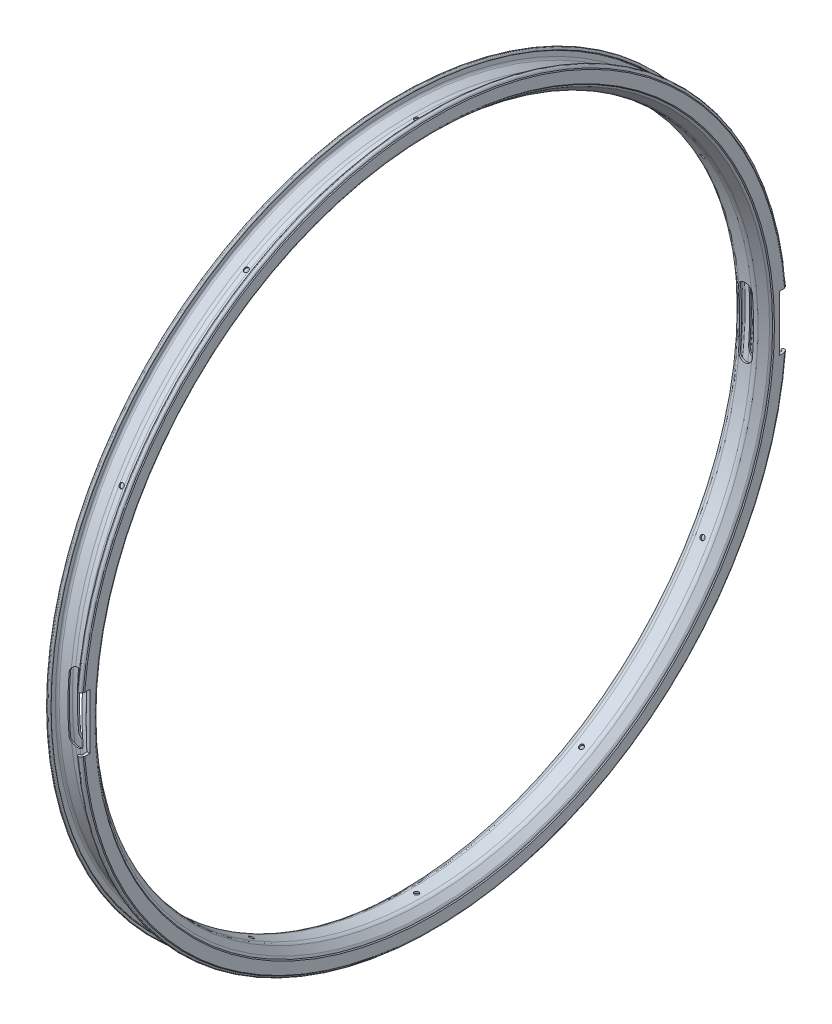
from build123d import *

# Parameters (mm, degrees)
CUT_EXTRUDE1_DEPTH      = 344.412779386
CUT_EXTRUDE1_DEPTH_BACK = 344.412779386
SKETCH3_R               = 1.5875
CUT_EXTRUDE2_DEPTH      = 344.412779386
CIRPATTERN1_COUNT       = 12
SKETCH4_W               = 25.4
SKETCH4_H               = 38.1
SKETCH4_W_2             = 22.556352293
CUT_EXTRUDE3_DEPTH      = 344.412779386


with BuildPart() as part:
    # Sketch1 → Base-Revolve (revolve)
    with BuildSketch(Plane.XY, mode=Mode.PRIVATE) as base_revolve_sk:
        with BuildLine():
            Line((-9.969499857, 242.671599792), (-10.2997, 242.671599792))
            ThreePointArc((-10.2997, 242.671599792), (-11.395291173, 242.217791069), (-11.849099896, 241.122199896))
            Line((-11.849099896, 241.122199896), (-12.3825, 240.5888))
            Line((-12.3825, 240.5888), (-12.3825, 232.9434))
            Line((-12.3825, 232.9434), (-11.771729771, 232.332629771))
            ThreePointArc((-11.771729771, 232.332629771), (-11.575375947, 231.527670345), (-11.074011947, 230.868012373))
            Line((-11.074011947, 230.868012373), (-6.8810849, 227.223156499))
            ThreePointArc((-6.8810849, 227.223156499), (-5.715790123, 226.529878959), (-4.3815, 226.2886))
            Line((-4.3815, 226.2886), (4.3815, 226.2886))
            ThreePointArc((4.3815, 226.2886), (5.715790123, 226.529878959), (6.8810849, 227.223156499))
            Line((6.8810849, 227.223156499), (11.074011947, 230.868012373))
            ThreePointArc((11.074011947, 230.868012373), (11.575375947, 231.527670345), (11.771729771, 232.332629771))
            Line((11.771729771, 232.332629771), (12.3825, 232.943399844))
            Line((12.3825, 232.943399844), (12.3825, 240.588799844))
            Line((12.3825, 240.588799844), (11.849099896, 241.122199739))
            ThreePointArc((11.849099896, 241.122199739), (11.395291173, 242.217790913), (10.2997, 242.671599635))
            Line((10.2997, 242.671599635), (9.969500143, 242.671599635))
            ThreePointArc((9.969500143, 242.671599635), (9.080500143, 241.782599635), (9.969500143, 240.893599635))
            Line((9.969500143, 240.893599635), (10.091960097, 240.893599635))
            ThreePointArc((10.091960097, 240.893599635), (10.468507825, 240.726592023), (10.59747155, 240.335378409))
            Line((10.59747155, 240.335378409), (10.298840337, 237.329448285))
            ThreePointArc((10.298840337, 237.329448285), (9.940673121, 236.420428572), (9.158652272, 235.834729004))
            Line((9.158652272, 235.834729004), (3.836788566, 233.791856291))
            ThreePointArc((3.836788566, 233.791856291), (2.698215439, 233.470745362), (1.52019, 233.3625))
            Line((1.52019, 233.3625), (-1.52019, 233.3625))
            ThreePointArc((-1.52019, 233.3625), (-2.698215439, 233.470745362), (-3.836788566, 233.791856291))
            Line((-3.836788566, 233.791856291), (-9.158652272, 235.834729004))
            ThreePointArc((-9.158652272, 235.834729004), (-9.940673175, 236.420428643), (-10.298840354, 237.329448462))
            Line((-10.298840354, 237.329448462), (-10.597471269, 240.335378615))
            ThreePointArc((-10.597471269, 240.335378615), (-10.468507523, 240.726592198), (-10.091959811, 240.893599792))
            Line((-10.091959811, 240.893599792), (-9.969499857, 240.893599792))
            ThreePointArc((-9.969499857, 240.893599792), (-9.080499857, 241.782599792), (-9.969499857, 242.671599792))
        make_face()
        with BuildLine():
            Line((-4.016705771, 232.923770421), (-9.568001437, 234.931424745))
            ThreePointArc((-9.568001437, 234.931424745), (-10.288087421, 234.83549936), (-10.623193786, 234.190961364))
            Line((-10.623193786, 234.190961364), (-10.623193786, 232.733044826))
            ThreePointArc((-10.623193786, 232.733044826), (-10.481400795, 232.079985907), (-10.081555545, 231.544528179))
            Line((-10.081555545, 231.544528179), (-7.051472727, 228.910517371))
            ThreePointArc((-7.051472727, 228.910517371), (-5.439715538, 227.882162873), (-3.561993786, 227.522391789))
            Line((-3.561993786, 227.522391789), (3.561993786, 227.522391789))
            ThreePointArc((3.561993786, 227.522391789), (5.439715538, 227.882162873), (7.051472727, 228.910517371))
            Line((7.051472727, 228.910517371), (10.256902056, 231.509877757))
            ThreePointArc((10.256902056, 231.509877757), (10.687755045, 232.057929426), (10.839797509, 232.73828082))
            Line((10.839797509, 232.73828082), (10.833627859, 234.593880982))
            ThreePointArc((10.833627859, 234.593880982), (10.458222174, 235.193346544), (9.753156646, 235.249658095))
            Line((9.753156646, 235.249658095), (4.28455684, 233.026602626))
            ThreePointArc((4.28455684, 233.026602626), (2.928536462, 232.622567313), (1.52019, 232.4862))
            Line((1.52019, 232.4862), (-1.52019, 232.4862))
            ThreePointArc((-1.52019, 232.4862), (-2.787476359, 232.59642009), (-4.016705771, 232.923770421))
        make_face(mode=Mode.SUBTRACT)
    revolve(base_revolve_sk.sketch.rotate(Axis((-76.2, 0, 0), (1, 0, 0)), 90), axis=Axis((-76.2, 0, 0), (1, 0, 0)))

    # Sketch2 → Cut-Extrude1 (cut, two sides: drawn at the far end of the back side and taken through both)
    with BuildSketch(Plane.XY.offset(-CUT_EXTRUDE1_DEPTH_BACK)):
        with BuildLine():
            Line((4.75107, -19.05), (4.75107, 19.05))
            ThreePointArc((4.75107, 19.05), (-0.0127, 23.81377), (-4.77647, 19.05))
            Line((-4.77647, 19.05), (-4.77647, -19.05))
            ThreePointArc((-4.77647, -19.05), (-0.0127, -23.81377), (4.75107, -19.05))
        make_face()
    extrude(amount=CUT_EXTRUDE1_DEPTH + CUT_EXTRUDE1_DEPTH_BACK, mode=Mode.SUBTRACT)

    # Sketch3 → Cut-Extrude2 (cut, through all)
    with BuildSketch(Plane(origin=(0, 0, 0), x_dir=(1, 0, 0), z_dir=(0, 1, 0))):
        with Locations(Location((0, 0, 0), (0, 0, 196.744305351))):
            Circle(SKETCH3_R)
    cut_extrude2 = extrude(amount=-CUT_EXTRUDE2_DEPTH, mode=Mode.SUBTRACT)

    # CirPattern1: Cut-Extrude2 ×12 about axis
    cirpattern1_axis = Axis((-76.2, 0, 0), (1, 0, 0))
    for i in range(1, CIRPATTERN1_COUNT):
        add(cut_extrude2.rotate(cirpattern1_axis, i * 360 / CIRPATTERN1_COUNT), mode=Mode.SUBTRACT)

    # Sketch4 → Cut-Extrude3 (cut, through all)
    with BuildSketch(Plane(origin=(0, 0, 0), x_dir=(0, 0, -1), z_dir=(1, 0, 0))):
        with Locations((248.92, 0)):
            Rectangle(SKETCH4_W, SKETCH4_H)
        with Locations((-247.498176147, 0)):
            Rectangle(SKETCH4_W_2, SKETCH4_H)
    extrude(amount=CUT_EXTRUDE3_DEPTH, mode=Mode.SUBTRACT)


solid = part.part
